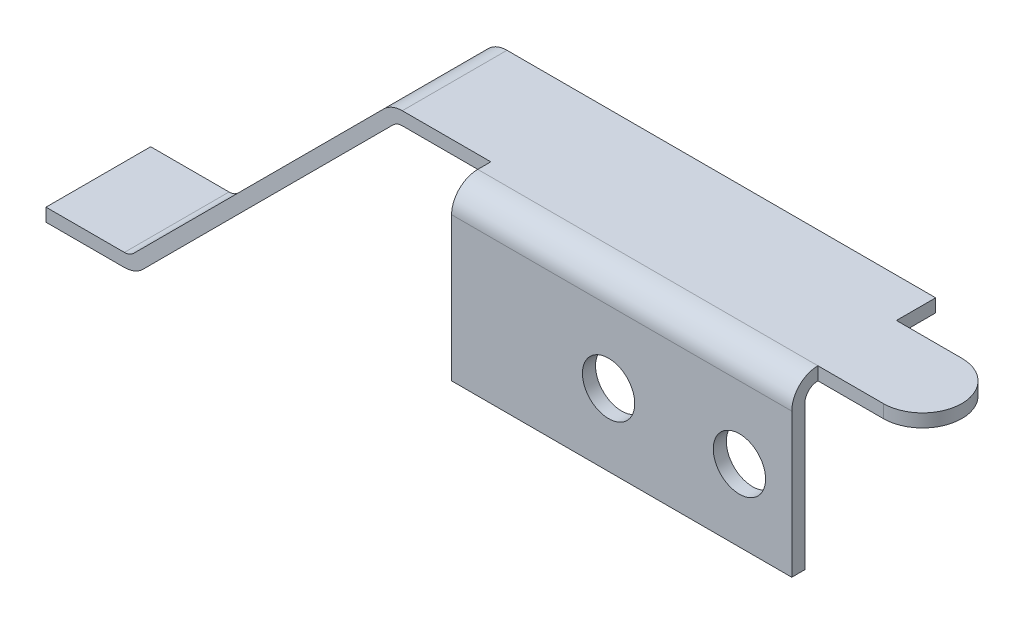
ISO-10303-21;
HEADER;
FILE_DESCRIPTION(('STEP AP214'),'2;1');
FILE_NAME('part.step','',(''),(''),'','','');
FILE_SCHEMA(('AUTOMOTIVE_DESIGN { 1 0 10303 214 1 1 1 1 }'));
ENDSEC;
DATA;
#1=APPLICATION_CONTEXT('core data for automotive mechanical design processes');
#2=APPLICATION_PROTOCOL_DEFINITION('international standard','automotive_design',2000,#1);
#3=PRODUCT_CONTEXT('',#1,'mechanical');
#4=PRODUCT('Part','Part','',(#3));
#5=PRODUCT_RELATED_PRODUCT_CATEGORY('part','',(#4));
#6=PRODUCT_DEFINITION_FORMATION('','',#4);
#7=PRODUCT_DEFINITION_CONTEXT('part definition',#1,'design');
#8=PRODUCT_DEFINITION('design','',#6,#7);
#9=PRODUCT_DEFINITION_SHAPE('','',#8);
#10=(LENGTH_UNIT() NAMED_UNIT(*) SI_UNIT(.MILLI.,.METRE.));
#11=(NAMED_UNIT(*) PLANE_ANGLE_UNIT() SI_UNIT($,.RADIAN.));
#12=(NAMED_UNIT(*) SI_UNIT($,.STERADIAN.) SOLID_ANGLE_UNIT());
#13=UNCERTAINTY_MEASURE_WITH_UNIT(LENGTH_MEASURE(1.E-05),#10,'distance_accuracy_value','');
#14=(GEOMETRIC_REPRESENTATION_CONTEXT(3) GLOBAL_UNCERTAINTY_ASSIGNED_CONTEXT((#13)) GLOBAL_UNIT_ASSIGNED_CONTEXT((#10,
#11,#12)) REPRESENTATION_CONTEXT('',''));
#15=CARTESIAN_POINT('',(0.,0.,0.));
#16=DIRECTION('',(0.,0.,1.));
#17=DIRECTION('',(1.,0.,0.));
#18=AXIS2_PLACEMENT_3D('',#15,#16,#17);
#19=CARTESIAN_POINT('',(13.6171067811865,9.5,4.));
#20=DIRECTION('',(0.,0.,1.));
#21=DIRECTION('',(1.,0.,0.));
#22=AXIS2_PLACEMENT_3D('',#19,#20,#21);
#23=PLANE('',#22);
#24=DIRECTION('',(1.,0.,0.));
#25=VECTOR('',#24,1.);
#26=CARTESIAN_POINT('',(13.6171067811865,10.,4.));
#27=LINE('',#26,#25);
#28=CARTESIAN_POINT('',(13.6171067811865,10.,4.));
#29=VERTEX_POINT('',#28);
#30=CARTESIAN_POINT('',(17.,10.,4.));
#31=VERTEX_POINT('',#30);
#32=EDGE_CURVE('E275',#29,#31,#27,.T.);
#33=ORIENTED_EDGE('',*,*,#32,.T.);
#34=DIRECTION('',(0.,-1.,0.));
#35=VECTOR('',#34,1.);
#36=CARTESIAN_POINT('',(17.,10.5,4.));
#37=LINE('',#36,#35);
#38=CARTESIAN_POINT('',(17.,10.5,4.));
#39=VERTEX_POINT('',#38);
#40=EDGE_CURVE('E224',#39,#31,#37,.T.);
#41=ORIENTED_EDGE('',*,*,#40,.F.);
#42=DIRECTION('',(1.,0.,0.));
#43=VECTOR('',#42,1.);
#44=CARTESIAN_POINT('',(13.6171067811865,10.5,4.));
#45=LINE('',#44,#43);
#46=CARTESIAN_POINT('',(13.6171067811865,10.5,4.));
#47=VERTEX_POINT('',#46);
#48=EDGE_CURVE('E277',#47,#39,#45,.T.);
#49=ORIENTED_EDGE('',*,*,#48,.F.);
#50=CARTESIAN_POINT('',(13.6171067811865,9.5,4.));
#51=DIRECTION('',(0.,0.,1.));
#52=DIRECTION('',(1.,0.,0.));
#53=AXIS2_PLACEMENT_3D('',#50,#51,#52);
#54=CIRCLE('',#53,0.999999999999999);
#55=CARTESIAN_POINT('',(12.91,10.2071067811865,4.));
#56=VERTEX_POINT('',#55);
#57=EDGE_CURVE('E283',#56,#47,#54,.F.);
#58=ORIENTED_EDGE('',*,*,#57,.F.);
#59=DIRECTION('',(0.707106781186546,0.707106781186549,0.));
#60=VECTOR('',#59,1.);
#61=CARTESIAN_POINT('',(3.34933982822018,0.646446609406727,4.));
#62=LINE('',#61,#60);
#63=CARTESIAN_POINT('',(3.34933982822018,0.646446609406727,4.));
#64=VERTEX_POINT('',#63);
#65=EDGE_CURVE('E288',#64,#56,#62,.T.);
#66=ORIENTED_EDGE('',*,*,#65,.F.);
#67=CARTESIAN_POINT('',(2.9957864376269,1.,4.));
#68=DIRECTION('',(0.,0.,1.));
#69=DIRECTION('',(1.,0.,0.));
#70=AXIS2_PLACEMENT_3D('',#67,#68,#69);
#71=CIRCLE('',#70,0.5);
#72=CARTESIAN_POINT('',(2.9957864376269,0.5,4.));
#73=VERTEX_POINT('',#72);
#74=EDGE_CURVE('E293',#73,#64,#71,.T.);
#75=ORIENTED_EDGE('',*,*,#74,.F.);
#76=DIRECTION('',(1.,0.,0.));
#77=VECTOR('',#76,1.);
#78=CARTESIAN_POINT('',(0.,0.5,4.));
#79=LINE('',#78,#77);
#80=CARTESIAN_POINT('',(0.,0.5,4.));
#81=VERTEX_POINT('',#80);
#82=EDGE_CURVE('E300',#81,#73,#79,.T.);
#83=ORIENTED_EDGE('',*,*,#82,.F.);
#84=DIRECTION('',(0.,1.,0.));
#85=VECTOR('',#84,1.);
#86=CARTESIAN_POINT('',(0.,0.,4.));
#87=LINE('',#86,#85);
#88=CARTESIAN_POINT('',(0.,0.,4.));
#89=VERTEX_POINT('',#88);
#90=EDGE_CURVE('E303',#89,#81,#87,.T.);
#91=ORIENTED_EDGE('',*,*,#90,.F.);
#92=DIRECTION('',(1.,0.,0.));
#93=VECTOR('',#92,1.);
#94=CARTESIAN_POINT('',(0.,0.,4.));
#95=LINE('',#94,#93);
#96=CARTESIAN_POINT('',(2.9957864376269,0.,4.));
#97=VERTEX_POINT('',#96);
#98=EDGE_CURVE('E306',#89,#97,#95,.T.);
#99=ORIENTED_EDGE('',*,*,#98,.T.);
#100=CARTESIAN_POINT('',(2.9957864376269,1.,4.));
#101=DIRECTION('',(0.,0.,1.));
#102=DIRECTION('',(-1.,0.,0.));
#103=AXIS2_PLACEMENT_3D('',#100,#101,#102);
#104=CIRCLE('',#103,1.);
#105=CARTESIAN_POINT('',(3.70289321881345,0.292893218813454,4.));
#106=VERTEX_POINT('',#105);
#107=EDGE_CURVE('E308',#97,#106,#104,.T.);
#108=ORIENTED_EDGE('',*,*,#107,.T.);
#109=DIRECTION('',(0.707106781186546,0.707106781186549,0.));
#110=VECTOR('',#109,1.);
#111=CARTESIAN_POINT('',(3.70289321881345,0.292893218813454,4.));
#112=LINE('',#111,#110);
#113=CARTESIAN_POINT('',(13.2635533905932,9.85355339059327,4.));
#114=VERTEX_POINT('',#113);
#115=EDGE_CURVE('E310',#106,#114,#112,.T.);
#116=ORIENTED_EDGE('',*,*,#115,.T.);
#117=CARTESIAN_POINT('',(13.6171067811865,9.5,4.));
#118=DIRECTION('',(0.,0.,-1.));
#119=DIRECTION('',(-1.,0.,0.));
#120=AXIS2_PLACEMENT_3D('',#117,#118,#119);
#121=CIRCLE('',#120,0.499999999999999);
#122=EDGE_CURVE('E56',#114,#29,#121,.T.);
#123=ORIENTED_EDGE('',*,*,#122,.T.);
#124=EDGE_LOOP('',(#33,#41,#49,#58,#66,#75,#83,#91,#99,#108,#116,#123));
#125=FACE_BOUND('',#124,.T.);
#126=ADVANCED_FACE('F32',(#125),#23,.T.);
#127=CARTESIAN_POINT('',(13.6171067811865,10.,4.));
#128=DIRECTION('',(0.,1.,0.));
#129=DIRECTION('',(0.,0.,1.));
#130=AXIS2_PLACEMENT_3D('',#127,#128,#129);
#131=PLANE('',#130);
#132=DIRECTION('',(1.,0.,0.));
#133=VECTOR('',#132,1.);
#134=CARTESIAN_POINT('',(13.6171067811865,10.,0.));
#135=LINE('',#134,#133);
#136=CARTESIAN_POINT('',(13.6171067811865,10.,0.));
#137=VERTEX_POINT('',#136);
#138=CARTESIAN_POINT('',(30.,10.,0.));
#139=VERTEX_POINT('',#138);
#140=EDGE_CURVE('E272',#137,#139,#135,.T.);
#141=ORIENTED_EDGE('',*,*,#140,.T.);
#142=DIRECTION('',(0.,0.,-1.));
#143=VECTOR('',#142,1.);
#144=CARTESIAN_POINT('',(30.,10.,4.));
#145=LINE('',#144,#143);
#146=CARTESIAN_POINT('',(30.,10.,1.5));
#147=VERTEX_POINT('',#146);
#148=EDGE_CURVE('E11',#147,#139,#145,.T.);
#149=ORIENTED_EDGE('',*,*,#148,.F.);
#150=DIRECTION('',(1.,0.,0.));
#151=VECTOR('',#150,1.);
#152=CARTESIAN_POINT('',(30.,10.,1.5));
#153=LINE('',#152,#151);
#154=CARTESIAN_POINT('',(32.5,10.,1.5));
#155=VERTEX_POINT('',#154);
#156=EDGE_CURVE('E249',#147,#155,#153,.T.);
#157=ORIENTED_EDGE('',*,*,#156,.T.);
#158=CARTESIAN_POINT('',(32.5,10.,3.));
#159=DIRECTION('',(0.,1.,0.));
#160=DIRECTION('',(0.,0.,1.));
#161=AXIS2_PLACEMENT_3D('',#158,#159,#160);
#162=CIRCLE('',#161,1.5);
#163=CARTESIAN_POINT('',(32.5,10.,4.5));
#164=VERTEX_POINT('',#163);
#165=EDGE_CURVE('E246',#155,#164,#162,.F.);
#166=ORIENTED_EDGE('',*,*,#165,.T.);
#167=DIRECTION('',(-1.,0.,0.));
#168=VECTOR('',#167,1.);
#169=CARTESIAN_POINT('',(32.5,10.,4.5));
#170=LINE('',#169,#168);
#171=CARTESIAN_POINT('',(30.,10.,4.5));
#172=VERTEX_POINT('',#171);
#173=EDGE_CURVE('E243',#164,#172,#170,.T.);
#174=ORIENTED_EDGE('',*,*,#173,.T.);
#175=DIRECTION('',(1.,0.,0.));
#176=VECTOR('',#175,1.);
#177=CARTESIAN_POINT('',(17.,10.,4.5));
#178=LINE('',#177,#176);
#179=CARTESIAN_POINT('',(17.,10.,4.5));
#180=VERTEX_POINT('',#179);
#181=EDGE_CURVE('E237',#180,#172,#178,.T.);
#182=ORIENTED_EDGE('',*,*,#181,.F.);
#183=DIRECTION('',(0.,0.,1.));
#184=VECTOR('',#183,1.);
#185=CARTESIAN_POINT('',(17.,10.,4.));
#186=LINE('',#185,#184);
#187=EDGE_CURVE('E222',#31,#180,#186,.T.);
#188=ORIENTED_EDGE('',*,*,#187,.F.);
#189=ORIENTED_EDGE('',*,*,#32,.F.);
#190=DIRECTION('',(0.,0.,-1.));
#191=VECTOR('',#190,1.);
#192=CARTESIAN_POINT('',(13.6171067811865,10.,4.));
#193=LINE('',#192,#191);
#194=EDGE_CURVE('E313',#29,#137,#193,.T.);
#195=ORIENTED_EDGE('',*,*,#194,.T.);
#196=EDGE_LOOP('',(#141,#149,#157,#166,#174,#182,#188,#189,#195));
#197=FACE_BOUND('',#196,.T.);
#198=ADVANCED_FACE('F34',(#197),#131,.F.);
#199=CARTESIAN_POINT('',(30.,10.5,4.));
#200=DIRECTION('',(1.,0.,0.));
#201=DIRECTION('',(0.,0.,-1.));
#202=AXIS2_PLACEMENT_3D('',#199,#200,#201);
#203=PLANE('',#202);
#204=DIRECTION('',(0.,1.,0.));
#205=VECTOR('',#204,1.);
#206=CARTESIAN_POINT('',(30.,5.,1.5));
#207=LINE('',#206,#205);
#208=CARTESIAN_POINT('',(30.,10.5,1.5));
#209=VERTEX_POINT('',#208);
#210=EDGE_CURVE('E48',#147,#209,#207,.T.);
#211=ORIENTED_EDGE('',*,*,#210,.F.);
#212=ORIENTED_EDGE('',*,*,#148,.T.);
#213=DIRECTION('',(0.,-1.,0.));
#214=VECTOR('',#213,1.);
#215=CARTESIAN_POINT('',(30.,10.5,0.));
#216=LINE('',#215,#214);
#217=CARTESIAN_POINT('',(30.,10.5,0.));
#218=VERTEX_POINT('',#217);
#219=EDGE_CURVE('E347',#218,#139,#216,.T.);
#220=ORIENTED_EDGE('',*,*,#219,.F.);
#221=DIRECTION('',(0.,0.,-1.));
#222=VECTOR('',#221,1.);
#223=CARTESIAN_POINT('',(30.,10.5,4.));
#224=LINE('',#223,#222);
#225=EDGE_CURVE('E41',#209,#218,#224,.T.);
#226=ORIENTED_EDGE('',*,*,#225,.F.);
#227=EDGE_LOOP('',(#211,#212,#220,#226));
#228=FACE_BOUND('',#227,.T.);
#229=ADVANCED_FACE('F348',(#228),#203,.T.);
#230=CARTESIAN_POINT('',(13.6171067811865,10.5,4.));
#231=DIRECTION('',(0.,1.,0.));
#232=DIRECTION('',(0.,0.,1.));
#233=AXIS2_PLACEMENT_3D('',#230,#231,#232);
#234=PLANE('',#233);
#235=DIRECTION('',(1.,0.,0.));
#236=VECTOR('',#235,1.);
#237=CARTESIAN_POINT('',(13.6171067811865,10.5,0.));
#238=LINE('',#237,#236);
#239=CARTESIAN_POINT('',(13.6171067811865,10.5,0.));
#240=VERTEX_POINT('',#239);
#241=EDGE_CURVE('E343',#240,#218,#238,.T.);
#242=ORIENTED_EDGE('',*,*,#241,.F.);
#243=DIRECTION('',(0.,0.,-1.));
#244=VECTOR('',#243,1.);
#245=CARTESIAN_POINT('',(13.6171067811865,10.5,4.));
#246=LINE('',#245,#244);
#247=EDGE_CURVE('E335',#47,#240,#246,.T.);
#248=ORIENTED_EDGE('',*,*,#247,.F.);
#249=ORIENTED_EDGE('',*,*,#48,.T.);
#250=DIRECTION('',(0.,0.,-1.));
#251=VECTOR('',#250,1.);
#252=CARTESIAN_POINT('',(17.,10.5,4.));
#253=LINE('',#252,#251);
#254=CARTESIAN_POINT('',(17.,10.5,4.49999999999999));
#255=VERTEX_POINT('',#254);
#256=EDGE_CURVE('E226',#39,#255,#253,.F.);
#257=ORIENTED_EDGE('',*,*,#256,.T.);
#258=DIRECTION('',(1.,0.,0.));
#259=VECTOR('',#258,1.);
#260=CARTESIAN_POINT('',(17.,10.5,4.49999999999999));
#261=LINE('',#260,#259);
#262=CARTESIAN_POINT('',(30.,10.5,4.49999999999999));
#263=VERTEX_POINT('',#262);
#264=EDGE_CURVE('E234',#255,#263,#261,.T.);
#265=ORIENTED_EDGE('',*,*,#264,.T.);
#266=DIRECTION('',(1.,0.,0.));
#267=VECTOR('',#266,1.);
#268=CARTESIAN_POINT('',(32.5,10.5,4.5));
#269=LINE('',#268,#267);
#270=CARTESIAN_POINT('',(32.5,10.5,4.5));
#271=VERTEX_POINT('',#270);
#272=EDGE_CURVE('E253',#263,#271,#269,.T.);
#273=ORIENTED_EDGE('',*,*,#272,.T.);
#274=CARTESIAN_POINT('',(32.5,10.5,3.));
#275=DIRECTION('',(0.,1.,0.));
#276=DIRECTION('',(0.,0.,1.));
#277=AXIS2_PLACEMENT_3D('',#274,#275,#276);
#278=CIRCLE('',#277,1.5);
#279=CARTESIAN_POINT('',(32.5,10.5,1.5));
#280=VERTEX_POINT('',#279);
#281=EDGE_CURVE('E233',#271,#280,#278,.T.);
#282=ORIENTED_EDGE('',*,*,#281,.T.);
#283=DIRECTION('',(-1.,0.,0.));
#284=VECTOR('',#283,1.);
#285=CARTESIAN_POINT('',(30.,10.5,1.5));
#286=LINE('',#285,#284);
#287=EDGE_CURVE('E252',#280,#209,#286,.T.);
#288=ORIENTED_EDGE('',*,*,#287,.T.);
#289=ORIENTED_EDGE('',*,*,#225,.T.);
#290=EDGE_LOOP('',(#242,#248,#249,#257,#265,#273,#282,#288,#289));
#291=FACE_BOUND('',#290,.T.);
#292=ADVANCED_FACE('F341',(#291),#234,.T.);
#293=CARTESIAN_POINT('',(13.6171067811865,9.5,4.));
#294=DIRECTION('',(0.,0.,-1.));
#295=DIRECTION('',(-1.,0.,0.));
#296=AXIS2_PLACEMENT_3D('',#293,#294,#295);
#297=CYLINDRICAL_SURFACE('',#296,0.999999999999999);
#298=CARTESIAN_POINT('',(13.6171067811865,9.5,0.));
#299=DIRECTION('',(0.,0.,1.));
#300=DIRECTION('',(1.,0.,0.));
#301=AXIS2_PLACEMENT_3D('',#298,#299,#300);
#302=CIRCLE('',#301,0.999999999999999);
#303=CARTESIAN_POINT('',(12.91,10.2071067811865,0.));
#304=VERTEX_POINT('',#303);
#305=EDGE_CURVE('E356',#304,#240,#302,.F.);
#306=ORIENTED_EDGE('',*,*,#305,.F.);
#307=DIRECTION('',(0.,0.,-1.));
#308=VECTOR('',#307,1.);
#309=CARTESIAN_POINT('',(12.91,10.2071067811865,4.));
#310=LINE('',#309,#308);
#311=EDGE_CURVE('E333',#56,#304,#310,.T.);
#312=ORIENTED_EDGE('',*,*,#311,.F.);
#313=ORIENTED_EDGE('',*,*,#57,.T.);
#314=ORIENTED_EDGE('',*,*,#247,.T.);
#315=EDGE_LOOP('',(#306,#312,#313,#314));
#316=FACE_BOUND('',#315,.T.);
#317=ADVANCED_FACE('F459',(#316),#297,.T.);
#318=CARTESIAN_POINT('',(3.34933982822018,0.646446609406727,4.));
#319=DIRECTION('',(-0.707106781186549,0.707106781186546,0.));
#320=DIRECTION('',(-0.707106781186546,-0.707106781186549,0.));
#321=AXIS2_PLACEMENT_3D('',#318,#319,#320);
#322=PLANE('',#321);
#323=DIRECTION('',(0.707106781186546,0.707106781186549,0.));
#324=VECTOR('',#323,1.);
#325=CARTESIAN_POINT('',(3.34933982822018,0.646446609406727,0.));
#326=LINE('',#325,#324);
#327=CARTESIAN_POINT('',(3.34933982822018,0.646446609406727,0.));
#328=VERTEX_POINT('',#327);
#329=EDGE_CURVE('E358',#328,#304,#326,.T.);
#330=ORIENTED_EDGE('',*,*,#329,.F.);
#331=DIRECTION('',(0.,0.,-1.));
#332=VECTOR('',#331,1.);
#333=CARTESIAN_POINT('',(3.34933982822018,0.646446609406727,4.));
#334=LINE('',#333,#332);
#335=EDGE_CURVE('E331',#64,#328,#334,.T.);
#336=ORIENTED_EDGE('',*,*,#335,.F.);
#337=ORIENTED_EDGE('',*,*,#65,.T.);
#338=ORIENTED_EDGE('',*,*,#311,.T.);
#339=EDGE_LOOP('',(#330,#336,#337,#338));
#340=FACE_BOUND('',#339,.T.);
#341=ADVANCED_FACE('F455',(#340),#322,.T.);
#342=CARTESIAN_POINT('',(2.9957864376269,1.,4.));
#343=DIRECTION('',(0.,0.,-1.));
#344=DIRECTION('',(-1.,0.,0.));
#345=AXIS2_PLACEMENT_3D('',#342,#343,#344);
#346=CYLINDRICAL_SURFACE('',#345,0.5);
#347=CARTESIAN_POINT('',(2.9957864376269,1.,0.));
#348=DIRECTION('',(0.,0.,1.));
#349=DIRECTION('',(1.,0.,0.));
#350=AXIS2_PLACEMENT_3D('',#347,#348,#349);
#351=CIRCLE('',#350,0.5);
#352=CARTESIAN_POINT('',(2.9957864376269,0.5,0.));
#353=VERTEX_POINT('',#352);
#354=EDGE_CURVE('E362',#353,#328,#351,.T.);
#355=ORIENTED_EDGE('',*,*,#354,.F.);
#356=DIRECTION('',(0.,0.,-1.));
#357=VECTOR('',#356,1.);
#358=CARTESIAN_POINT('',(2.9957864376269,0.5,4.));
#359=LINE('',#358,#357);
#360=EDGE_CURVE('E329',#73,#353,#359,.T.);
#361=ORIENTED_EDGE('',*,*,#360,.F.);
#362=ORIENTED_EDGE('',*,*,#74,.T.);
#363=ORIENTED_EDGE('',*,*,#335,.T.);
#364=EDGE_LOOP('',(#355,#361,#362,#363));
#365=FACE_BOUND('',#364,.T.);
#366=ADVANCED_FACE('F451',(#365),#346,.F.);
#367=CARTESIAN_POINT('',(0.,0.5,4.));
#368=DIRECTION('',(0.,1.,0.));
#369=DIRECTION('',(0.,0.,1.));
#370=AXIS2_PLACEMENT_3D('',#367,#368,#369);
#371=PLANE('',#370);
#372=DIRECTION('',(1.,0.,0.));
#373=VECTOR('',#372,1.);
#374=CARTESIAN_POINT('',(0.,0.5,0.));
#375=LINE('',#374,#373);
#376=CARTESIAN_POINT('',(0.,0.5,0.));
#377=VERTEX_POINT('',#376);
#378=EDGE_CURVE('E365',#377,#353,#375,.T.);
#379=ORIENTED_EDGE('',*,*,#378,.F.);
#380=DIRECTION('',(0.,0.,-1.));
#381=VECTOR('',#380,1.);
#382=CARTESIAN_POINT('',(0.,0.5,4.));
#383=LINE('',#382,#381);
#384=EDGE_CURVE('E327',#81,#377,#383,.T.);
#385=ORIENTED_EDGE('',*,*,#384,.F.);
#386=ORIENTED_EDGE('',*,*,#82,.T.);
#387=ORIENTED_EDGE('',*,*,#360,.T.);
#388=EDGE_LOOP('',(#379,#385,#386,#387));
#389=FACE_BOUND('',#388,.T.);
#390=ADVANCED_FACE('F447',(#389),#371,.T.);
#391=CARTESIAN_POINT('',(0.,0.,4.));
#392=DIRECTION('',(-1.,0.,0.));
#393=DIRECTION('',(0.,0.,1.));
#394=AXIS2_PLACEMENT_3D('',#391,#392,#393);
#395=PLANE('',#394);
#396=DIRECTION('',(0.,1.,0.));
#397=VECTOR('',#396,1.);
#398=CARTESIAN_POINT('',(0.,0.,0.));
#399=LINE('',#398,#397);
#400=CARTESIAN_POINT('',(0.,0.,0.));
#401=VERTEX_POINT('',#400);
#402=EDGE_CURVE('E368',#401,#377,#399,.T.);
#403=ORIENTED_EDGE('',*,*,#402,.F.);
#404=DIRECTION('',(0.,0.,-1.));
#405=VECTOR('',#404,1.);
#406=CARTESIAN_POINT('',(0.,0.,4.));
#407=LINE('',#406,#405);
#408=EDGE_CURVE('E325',#89,#401,#407,.T.);
#409=ORIENTED_EDGE('',*,*,#408,.F.);
#410=ORIENTED_EDGE('',*,*,#90,.T.);
#411=ORIENTED_EDGE('',*,*,#384,.T.);
#412=EDGE_LOOP('',(#403,#409,#410,#411));
#413=FACE_BOUND('',#412,.T.);
#414=ADVANCED_FACE('F443',(#413),#395,.T.);
#415=CARTESIAN_POINT('',(0.,0.,4.));
#416=DIRECTION('',(0.,1.,0.));
#417=DIRECTION('',(0.,0.,1.));
#418=AXIS2_PLACEMENT_3D('',#415,#416,#417);
#419=PLANE('',#418);
#420=DIRECTION('',(1.,0.,0.));
#421=VECTOR('',#420,1.);
#422=CARTESIAN_POINT('',(0.,0.,0.));
#423=LINE('',#422,#421);
#424=CARTESIAN_POINT('',(2.9957864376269,0.,0.));
#425=VERTEX_POINT('',#424);
#426=EDGE_CURVE('E371',#401,#425,#423,.T.);
#427=ORIENTED_EDGE('',*,*,#426,.T.);
#428=DIRECTION('',(0.,0.,-1.));
#429=VECTOR('',#428,1.);
#430=CARTESIAN_POINT('',(2.9957864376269,0.,4.));
#431=LINE('',#430,#429);
#432=EDGE_CURVE('E322',#97,#425,#431,.T.);
#433=ORIENTED_EDGE('',*,*,#432,.F.);
#434=ORIENTED_EDGE('',*,*,#98,.F.);
#435=ORIENTED_EDGE('',*,*,#408,.T.);
#436=EDGE_LOOP('',(#427,#433,#434,#435));
#437=FACE_BOUND('',#436,.T.);
#438=ADVANCED_FACE('F439',(#437),#419,.F.);
#439=CARTESIAN_POINT('',(2.9957864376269,1.,4.));
#440=DIRECTION('',(0.,0.,-1.));
#441=DIRECTION('',(-1.,0.,0.));
#442=AXIS2_PLACEMENT_3D('',#439,#440,#441);
#443=CYLINDRICAL_SURFACE('',#442,1.);
#444=CARTESIAN_POINT('',(2.9957864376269,1.,0.));
#445=DIRECTION('',(0.,0.,1.));
#446=DIRECTION('',(-1.,0.,0.));
#447=AXIS2_PLACEMENT_3D('',#444,#445,#446);
#448=CIRCLE('',#447,1.);
#449=CARTESIAN_POINT('',(3.70289321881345,0.292893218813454,0.));
#450=VERTEX_POINT('',#449);
#451=EDGE_CURVE('E373',#425,#450,#448,.T.);
#452=ORIENTED_EDGE('',*,*,#451,.T.);
#453=DIRECTION('',(0.,0.,-1.));
#454=VECTOR('',#453,1.);
#455=CARTESIAN_POINT('',(3.70289321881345,0.292893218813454,4.));
#456=LINE('',#455,#454);
#457=EDGE_CURVE('E319',#106,#450,#456,.T.);
#458=ORIENTED_EDGE('',*,*,#457,.F.);
#459=ORIENTED_EDGE('',*,*,#107,.F.);
#460=ORIENTED_EDGE('',*,*,#432,.T.);
#461=EDGE_LOOP('',(#452,#458,#459,#460));
#462=FACE_BOUND('',#461,.T.);
#463=ADVANCED_FACE('F436',(#462),#443,.T.);
#464=CARTESIAN_POINT('',(3.70289321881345,0.292893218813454,4.));
#465=DIRECTION('',(-0.707106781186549,0.707106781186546,0.));
#466=DIRECTION('',(-0.707106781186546,-0.707106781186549,0.));
#467=AXIS2_PLACEMENT_3D('',#464,#465,#466);
#468=PLANE('',#467);
#469=DIRECTION('',(0.707106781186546,0.707106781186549,0.));
#470=VECTOR('',#469,1.);
#471=CARTESIAN_POINT('',(3.70289321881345,0.292893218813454,0.));
#472=LINE('',#471,#470);
#473=CARTESIAN_POINT('',(13.2635533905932,9.85355339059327,0.));
#474=VERTEX_POINT('',#473);
#475=EDGE_CURVE('E374',#450,#474,#472,.T.);
#476=ORIENTED_EDGE('',*,*,#475,.T.);
#477=DIRECTION('',(0.,0.,-1.));
#478=VECTOR('',#477,1.);
#479=CARTESIAN_POINT('',(13.2635533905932,9.85355339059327,4.));
#480=LINE('',#479,#478);
#481=EDGE_CURVE('E316',#114,#474,#480,.T.);
#482=ORIENTED_EDGE('',*,*,#481,.F.);
#483=ORIENTED_EDGE('',*,*,#115,.F.);
#484=ORIENTED_EDGE('',*,*,#457,.T.);
#485=EDGE_LOOP('',(#476,#482,#483,#484));
#486=FACE_BOUND('',#485,.T.);
#487=ADVANCED_FACE('F433',(#486),#468,.F.);
#488=CARTESIAN_POINT('',(13.6171067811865,9.5,4.));
#489=DIRECTION('',(0.,0.,-1.));
#490=DIRECTION('',(-1.,0.,0.));
#491=AXIS2_PLACEMENT_3D('',#488,#489,#490);
#492=CYLINDRICAL_SURFACE('',#491,0.499999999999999);
#493=CARTESIAN_POINT('',(13.6171067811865,9.5,0.));
#494=DIRECTION('',(0.,0.,-1.));
#495=DIRECTION('',(-1.,0.,0.));
#496=AXIS2_PLACEMENT_3D('',#493,#494,#495);
#497=CIRCLE('',#496,0.499999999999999);
#498=EDGE_CURVE('E278',#474,#137,#497,.T.);
#499=ORIENTED_EDGE('',*,*,#498,.T.);
#500=ORIENTED_EDGE('',*,*,#194,.F.);
#501=ORIENTED_EDGE('',*,*,#122,.F.);
#502=ORIENTED_EDGE('',*,*,#481,.T.);
#503=EDGE_LOOP('',(#499,#500,#501,#502));
#504=FACE_BOUND('',#503,.T.);
#505=ADVANCED_FACE('F380',(#504),#492,.F.);
#506=CARTESIAN_POINT('',(13.6171067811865,9.5,0.));
#507=DIRECTION('',(0.,0.,1.));
#508=DIRECTION('',(1.,0.,0.));
#509=AXIS2_PLACEMENT_3D('',#506,#507,#508);
#510=PLANE('',#509);
#511=ORIENTED_EDGE('',*,*,#140,.F.);
#512=ORIENTED_EDGE('',*,*,#498,.F.);
#513=ORIENTED_EDGE('',*,*,#475,.F.);
#514=ORIENTED_EDGE('',*,*,#451,.F.);
#515=ORIENTED_EDGE('',*,*,#426,.F.);
#516=ORIENTED_EDGE('',*,*,#402,.T.);
#517=ORIENTED_EDGE('',*,*,#378,.T.);
#518=ORIENTED_EDGE('',*,*,#354,.T.);
#519=ORIENTED_EDGE('',*,*,#329,.T.);
#520=ORIENTED_EDGE('',*,*,#305,.T.);
#521=ORIENTED_EDGE('',*,*,#241,.T.);
#522=ORIENTED_EDGE('',*,*,#219,.T.);
#523=EDGE_LOOP('',(#511,#512,#513,#514,#515,#516,#517,#518,#519,#520,#521,#522));
#524=FACE_BOUND('',#523,.T.);
#525=ADVANCED_FACE('F353',(#524),#510,.F.);
#526=CARTESIAN_POINT('',(32.5,5.,3.));
#527=DIRECTION('',(0.,1.,0.));
#528=DIRECTION('',(0.,0.,1.));
#529=AXIS2_PLACEMENT_3D('',#526,#527,#528);
#530=CYLINDRICAL_SURFACE('',#529,1.5);
#531=ORIENTED_EDGE('',*,*,#165,.F.);
#532=DIRECTION('',(0.,1.,0.));
#533=VECTOR('',#532,1.);
#534=CARTESIAN_POINT('',(32.5,5.,1.5));
#535=LINE('',#534,#533);
#536=EDGE_CURVE('E256',#155,#280,#535,.T.);
#537=ORIENTED_EDGE('',*,*,#536,.T.);
#538=ORIENTED_EDGE('',*,*,#281,.F.);
#539=DIRECTION('',(0.,1.,0.));
#540=VECTOR('',#539,1.);
#541=CARTESIAN_POINT('',(32.5,5.,4.5));
#542=LINE('',#541,#540);
#543=EDGE_CURVE('E247',#164,#271,#542,.T.);
#544=ORIENTED_EDGE('',*,*,#543,.F.);
#545=EDGE_LOOP('',(#531,#537,#538,#544));
#546=FACE_BOUND('',#545,.T.);
#547=ADVANCED_FACE('F400',(#546),#530,.T.);
#548=CARTESIAN_POINT('',(32.5,5.,4.5));
#549=DIRECTION('',(0.,0.,1.));
#550=DIRECTION('',(1.,0.,0.));
#551=AXIS2_PLACEMENT_3D('',#548,#549,#550);
#552=PLANE('',#551);
#553=ORIENTED_EDGE('',*,*,#173,.F.);
#554=ORIENTED_EDGE('',*,*,#543,.T.);
#555=ORIENTED_EDGE('',*,*,#272,.F.);
#556=DIRECTION('',(0.,1.,0.));
#557=VECTOR('',#556,1.);
#558=CARTESIAN_POINT('',(30.,5.,4.5));
#559=LINE('',#558,#557);
#560=EDGE_CURVE('E258',#172,#263,#559,.T.);
#561=ORIENTED_EDGE('',*,*,#560,.F.);
#562=EDGE_LOOP('',(#553,#554,#555,#561));
#563=FACE_BOUND('',#562,.T.);
#564=ADVANCED_FACE('F395',(#563),#552,.T.);
#565=CARTESIAN_POINT('',(30.,5.,1.5));
#566=DIRECTION('',(0.,0.,-1.));
#567=DIRECTION('',(-1.,0.,0.));
#568=AXIS2_PLACEMENT_3D('',#565,#566,#567);
#569=PLANE('',#568);
#570=ORIENTED_EDGE('',*,*,#156,.F.);
#571=ORIENTED_EDGE('',*,*,#210,.T.);
#572=ORIENTED_EDGE('',*,*,#287,.F.);
#573=ORIENTED_EDGE('',*,*,#536,.F.);
#574=EDGE_LOOP('',(#570,#571,#572,#573));
#575=FACE_BOUND('',#574,.T.);
#576=ADVANCED_FACE('F404',(#575),#569,.T.);
#577=CARTESIAN_POINT('',(17.,9.5,5.5));
#578=DIRECTION('',(0.,0.,1.));
#579=DIRECTION('',(0.,-1.,0.));
#580=AXIS2_PLACEMENT_3D('',#577,#578,#579);
#581=PLANE('',#580);
#582=CARTESIAN_POINT('',(28.,6.75,5.5));
#583=DIRECTION('',(0.,0.,1.));
#584=DIRECTION('',(1.,0.,0.));
#585=AXIS2_PLACEMENT_3D('',#582,#583,#584);
#586=CIRCLE('',#585,0.999999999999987);
#587=CARTESIAN_POINT('',(29.,6.75,5.5));
#588=VERTEX_POINT('',#587);
#589=EDGE_CURVE('E598',#588,#588,#586,.T.);
#590=ORIENTED_EDGE('',*,*,#589,.F.);
#591=EDGE_LOOP('',(#590));
#592=FACE_BOUND('',#591,.T.);
#593=CARTESIAN_POINT('',(23.,6.75,5.5));
#594=DIRECTION('',(0.,0.,1.));
#595=DIRECTION('',(1.,0.,0.));
#596=AXIS2_PLACEMENT_3D('',#593,#594,#595);
#597=CIRCLE('',#596,0.999999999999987);
#598=CARTESIAN_POINT('',(24.,6.75,5.5));
#599=VERTEX_POINT('',#598);
#600=EDGE_CURVE('E207',#599,#599,#597,.T.);
#601=ORIENTED_EDGE('',*,*,#600,.F.);
#602=EDGE_LOOP('',(#601));
#603=FACE_BOUND('',#602,.T.);
#604=DIRECTION('',(0.,-1.,0.));
#605=VECTOR('',#604,1.);
#606=CARTESIAN_POINT('',(30.,9.5,5.5));
#607=LINE('',#606,#605);
#608=CARTESIAN_POINT('',(30.,9.5,5.5));
#609=VERTEX_POINT('',#608);
#610=CARTESIAN_POINT('',(30.,4.,5.5));
#611=VERTEX_POINT('',#610);
#612=EDGE_CURVE('E182',#609,#611,#607,.T.);
#613=ORIENTED_EDGE('',*,*,#612,.F.);
#614=DIRECTION('',(1.,0.,0.));
#615=VECTOR('',#614,1.);
#616=CARTESIAN_POINT('',(17.,9.5,5.5));
#617=LINE('',#616,#615);
#618=CARTESIAN_POINT('',(17.,9.5,5.5));
#619=VERTEX_POINT('',#618);
#620=EDGE_CURVE('E231',#619,#609,#617,.T.);
#621=ORIENTED_EDGE('',*,*,#620,.F.);
#622=DIRECTION('',(0.,-1.,0.));
#623=VECTOR('',#622,1.);
#624=CARTESIAN_POINT('',(17.,9.5,5.5));
#625=LINE('',#624,#623);
#626=CARTESIAN_POINT('',(17.,4.,5.5));
#627=VERTEX_POINT('',#626);
#628=EDGE_CURVE('E185',#619,#627,#625,.T.);
#629=ORIENTED_EDGE('',*,*,#628,.T.);
#630=DIRECTION('',(1.,0.,0.));
#631=VECTOR('',#630,1.);
#632=CARTESIAN_POINT('',(17.,4.,5.5));
#633=LINE('',#632,#631);
#634=EDGE_CURVE('E178',#627,#611,#633,.T.);
#635=ORIENTED_EDGE('',*,*,#634,.T.);
#636=EDGE_LOOP('',(#613,#621,#629,#635));
#637=FACE_BOUND('',#636,.T.);
#638=ADVANCED_FACE('F180',(#592,#603,#637),#581,.T.);
#639=CARTESIAN_POINT('',(17.,9.5,4.5));
#640=DIRECTION('',(1.,0.,0.));
#641=DIRECTION('',(0.,0.,-1.));
#642=AXIS2_PLACEMENT_3D('',#639,#640,#641);
#643=CYLINDRICAL_SURFACE('',#642,1.);
#644=CARTESIAN_POINT('',(30.,9.5,4.5));
#645=DIRECTION('',(1.,0.,0.));
#646=DIRECTION('',(0.,0.,-1.));
#647=AXIS2_PLACEMENT_3D('',#644,#645,#646);
#648=CIRCLE('',#647,1.);
#649=EDGE_CURVE('E203',#263,#609,#648,.T.);
#650=ORIENTED_EDGE('',*,*,#649,.F.);
#651=ORIENTED_EDGE('',*,*,#264,.F.);
#652=CARTESIAN_POINT('',(17.,9.5,4.5));
#653=DIRECTION('',(1.,0.,0.));
#654=DIRECTION('',(0.,0.,-1.));
#655=AXIS2_PLACEMENT_3D('',#652,#653,#654);
#656=CIRCLE('',#655,1.);
#657=EDGE_CURVE('E189',#255,#619,#656,.T.);
#658=ORIENTED_EDGE('',*,*,#657,.T.);
#659=ORIENTED_EDGE('',*,*,#620,.T.);
#660=EDGE_LOOP('',(#650,#651,#658,#659));
#661=FACE_BOUND('',#660,.T.);
#662=ADVANCED_FACE('F391',(#661),#643,.T.);
#663=CARTESIAN_POINT('',(17.,9.5,4.5));
#664=DIRECTION('',(1.,0.,0.));
#665=DIRECTION('',(0.,0.,-1.));
#666=AXIS2_PLACEMENT_3D('',#663,#664,#665);
#667=CYLINDRICAL_SURFACE('',#666,0.5);
#668=CARTESIAN_POINT('',(30.,9.5,4.5));
#669=DIRECTION('',(1.,0.,0.));
#670=DIRECTION('',(0.,0.,-1.));
#671=AXIS2_PLACEMENT_3D('',#668,#669,#670);
#672=CIRCLE('',#671,0.5);
#673=CARTESIAN_POINT('',(30.,9.5,5.));
#674=VERTEX_POINT('',#673);
#675=EDGE_CURVE('E212',#172,#674,#672,.T.);
#676=ORIENTED_EDGE('',*,*,#675,.T.);
#677=DIRECTION('',(1.,0.,0.));
#678=VECTOR('',#677,1.);
#679=CARTESIAN_POINT('',(17.,9.5,5.));
#680=LINE('',#679,#678);
#681=CARTESIAN_POINT('',(17.,9.5,5.));
#682=VERTEX_POINT('',#681);
#683=EDGE_CURVE('E239',#682,#674,#680,.T.);
#684=ORIENTED_EDGE('',*,*,#683,.F.);
#685=CARTESIAN_POINT('',(17.,9.5,4.5));
#686=DIRECTION('',(1.,0.,0.));
#687=DIRECTION('',(0.,0.,-1.));
#688=AXIS2_PLACEMENT_3D('',#685,#686,#687);
#689=CIRCLE('',#688,0.5);
#690=EDGE_CURVE('E220',#180,#682,#689,.T.);
#691=ORIENTED_EDGE('',*,*,#690,.F.);
#692=ORIENTED_EDGE('',*,*,#181,.T.);
#693=EDGE_LOOP('',(#676,#684,#691,#692));
#694=FACE_BOUND('',#693,.T.);
#695=ADVANCED_FACE('F408',(#694),#667,.F.);
#696=CARTESIAN_POINT('',(17.,9.5,5.));
#697=DIRECTION('',(0.,0.,1.));
#698=DIRECTION('',(0.,-1.,0.));
#699=AXIS2_PLACEMENT_3D('',#696,#697,#698);
#700=PLANE('',#699);
#701=CARTESIAN_POINT('',(28.,6.75,5.));
#702=DIRECTION('',(0.,0.,1.));
#703=DIRECTION('',(0.,-1.,0.));
#704=AXIS2_PLACEMENT_3D('',#701,#702,#703);
#705=CIRCLE('',#704,0.999999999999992);
#706=CARTESIAN_POINT('',(28.,5.75000000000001,5.));
#707=VERTEX_POINT('',#706);
#708=EDGE_CURVE('E36',#707,#707,#705,.T.);
#709=ORIENTED_EDGE('',*,*,#708,.T.);
#710=EDGE_LOOP('',(#709));
#711=FACE_BOUND('',#710,.T.);
#712=CARTESIAN_POINT('',(23.,6.75,5.));
#713=DIRECTION('',(0.,0.,1.));
#714=DIRECTION('',(0.,-1.,0.));
#715=AXIS2_PLACEMENT_3D('',#712,#713,#714);
#716=CIRCLE('',#715,0.999999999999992);
#717=CARTESIAN_POINT('',(23.,5.75000000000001,5.));
#718=VERTEX_POINT('',#717);
#719=EDGE_CURVE('E204',#718,#718,#716,.T.);
#720=ORIENTED_EDGE('',*,*,#719,.T.);
#721=EDGE_LOOP('',(#720));
#722=FACE_BOUND('',#721,.T.);
#723=DIRECTION('',(0.,-1.,0.));
#724=VECTOR('',#723,1.);
#725=CARTESIAN_POINT('',(30.,9.5,5.));
#726=LINE('',#725,#724);
#727=CARTESIAN_POINT('',(30.,4.,5.));
#728=VERTEX_POINT('',#727);
#729=EDGE_CURVE('E198',#674,#728,#726,.T.);
#730=ORIENTED_EDGE('',*,*,#729,.T.);
#731=DIRECTION('',(1.,0.,0.));
#732=VECTOR('',#731,1.);
#733=CARTESIAN_POINT('',(17.,4.,5.));
#734=LINE('',#733,#732);
#735=CARTESIAN_POINT('',(17.,4.,5.));
#736=VERTEX_POINT('',#735);
#737=EDGE_CURVE('E188',#736,#728,#734,.T.);
#738=ORIENTED_EDGE('',*,*,#737,.F.);
#739=DIRECTION('',(0.,-1.,0.));
#740=VECTOR('',#739,1.);
#741=CARTESIAN_POINT('',(17.,9.5,5.));
#742=LINE('',#741,#740);
#743=EDGE_CURVE('E218',#682,#736,#742,.T.);
#744=ORIENTED_EDGE('',*,*,#743,.F.);
#745=ORIENTED_EDGE('',*,*,#683,.T.);
#746=EDGE_LOOP('',(#730,#738,#744,#745));
#747=FACE_BOUND('',#746,.T.);
#748=ADVANCED_FACE('F411',(#711,#722,#747),#700,.F.);
#749=CARTESIAN_POINT('',(17.,4.,5.));
#750=DIRECTION('',(0.,1.,0.));
#751=DIRECTION('',(0.,0.,1.));
#752=AXIS2_PLACEMENT_3D('',#749,#750,#751);
#753=PLANE('',#752);
#754=DIRECTION('',(0.,0.,1.));
#755=VECTOR('',#754,1.);
#756=CARTESIAN_POINT('',(30.,4.,5.));
#757=LINE('',#756,#755);
#758=EDGE_CURVE('E193',#728,#611,#757,.T.);
#759=ORIENTED_EDGE('',*,*,#758,.T.);
#760=ORIENTED_EDGE('',*,*,#634,.F.);
#761=DIRECTION('',(0.,0.,1.));
#762=VECTOR('',#761,1.);
#763=CARTESIAN_POINT('',(17.,4.,5.));
#764=LINE('',#763,#762);
#765=EDGE_CURVE('E216',#736,#627,#764,.T.);
#766=ORIENTED_EDGE('',*,*,#765,.F.);
#767=ORIENTED_EDGE('',*,*,#737,.T.);
#768=EDGE_LOOP('',(#759,#760,#766,#767));
#769=FACE_BOUND('',#768,.T.);
#770=ADVANCED_FACE('F194',(#769),#753,.F.);
#771=CARTESIAN_POINT('',(17.,9.5,4.5));
#772=DIRECTION('',(1.,0.,0.));
#773=DIRECTION('',(0.,0.,-1.));
#774=AXIS2_PLACEMENT_3D('',#771,#772,#773);
#775=PLANE('',#774);
#776=ORIENTED_EDGE('',*,*,#628,.F.);
#777=ORIENTED_EDGE('',*,*,#657,.F.);
#778=ORIENTED_EDGE('',*,*,#256,.F.);
#779=ORIENTED_EDGE('',*,*,#40,.T.);
#780=ORIENTED_EDGE('',*,*,#187,.T.);
#781=ORIENTED_EDGE('',*,*,#690,.T.);
#782=ORIENTED_EDGE('',*,*,#743,.T.);
#783=ORIENTED_EDGE('',*,*,#765,.T.);
#784=EDGE_LOOP('',(#776,#777,#778,#779,#780,#781,#782,#783));
#785=FACE_BOUND('',#784,.T.);
#786=ADVANCED_FACE('F387',(#785),#775,.F.);
#787=CARTESIAN_POINT('',(30.,9.5,4.5));
#788=DIRECTION('',(1.,0.,0.));
#789=DIRECTION('',(0.,0.,-1.));
#790=AXIS2_PLACEMENT_3D('',#787,#788,#789);
#791=PLANE('',#790);
#792=ORIENTED_EDGE('',*,*,#675,.F.);
#793=ORIENTED_EDGE('',*,*,#560,.T.);
#794=ORIENTED_EDGE('',*,*,#649,.T.);
#795=ORIENTED_EDGE('',*,*,#612,.T.);
#796=ORIENTED_EDGE('',*,*,#758,.F.);
#797=ORIENTED_EDGE('',*,*,#729,.F.);
#798=EDGE_LOOP('',(#792,#793,#794,#795,#796,#797));
#799=FACE_BOUND('',#798,.T.);
#800=ADVANCED_FACE('F201',(#799),#791,.T.);
#801=CARTESIAN_POINT('',(23.,6.75,5.5));
#802=DIRECTION('',(0.,0.,1.));
#803=DIRECTION('',(1.,0.,0.));
#804=AXIS2_PLACEMENT_3D('',#801,#802,#803);
#805=CYLINDRICAL_SURFACE('',#804,0.999999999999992);
#806=ORIENTED_EDGE('',*,*,#600,.T.);
#807=EDGE_LOOP('',(#806));
#808=FACE_BOUND('',#807,.T.);
#809=ORIENTED_EDGE('',*,*,#719,.F.);
#810=EDGE_LOOP('',(#809));
#811=FACE_BOUND('',#810,.T.);
#812=ADVANCED_FACE('F571',(#808,#811),#805,.F.);
#813=CARTESIAN_POINT('',(28.,6.75,5.5));
#814=DIRECTION('',(0.,0.,1.));
#815=DIRECTION('',(1.,0.,0.));
#816=AXIS2_PLACEMENT_3D('',#813,#814,#815);
#817=CYLINDRICAL_SURFACE('',#816,0.999999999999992);
#818=ORIENTED_EDGE('',*,*,#589,.T.);
#819=EDGE_LOOP('',(#818));
#820=FACE_BOUND('',#819,.T.);
#821=ORIENTED_EDGE('',*,*,#708,.F.);
#822=EDGE_LOOP('',(#821));
#823=FACE_BOUND('',#822,.T.);
#824=ADVANCED_FACE('F581',(#820,#823),#817,.F.);
#825=CLOSED_SHELL('',(#126,#198,#229,#292,#317,#341,#366,#390,#414,#438,#463,#487,#505,#525,
#547,#564,#576,#638,#662,#695,#748,#770,#786,#800,#812,#824));
#826=MANIFOLD_SOLID_BREP('B2',#825);
#827=ADVANCED_BREP_SHAPE_REPRESENTATION('',(#18,#826),#14);
#828=SHAPE_DEFINITION_REPRESENTATION(#9,#827);
ENDSEC;
END-ISO-10303-21;
